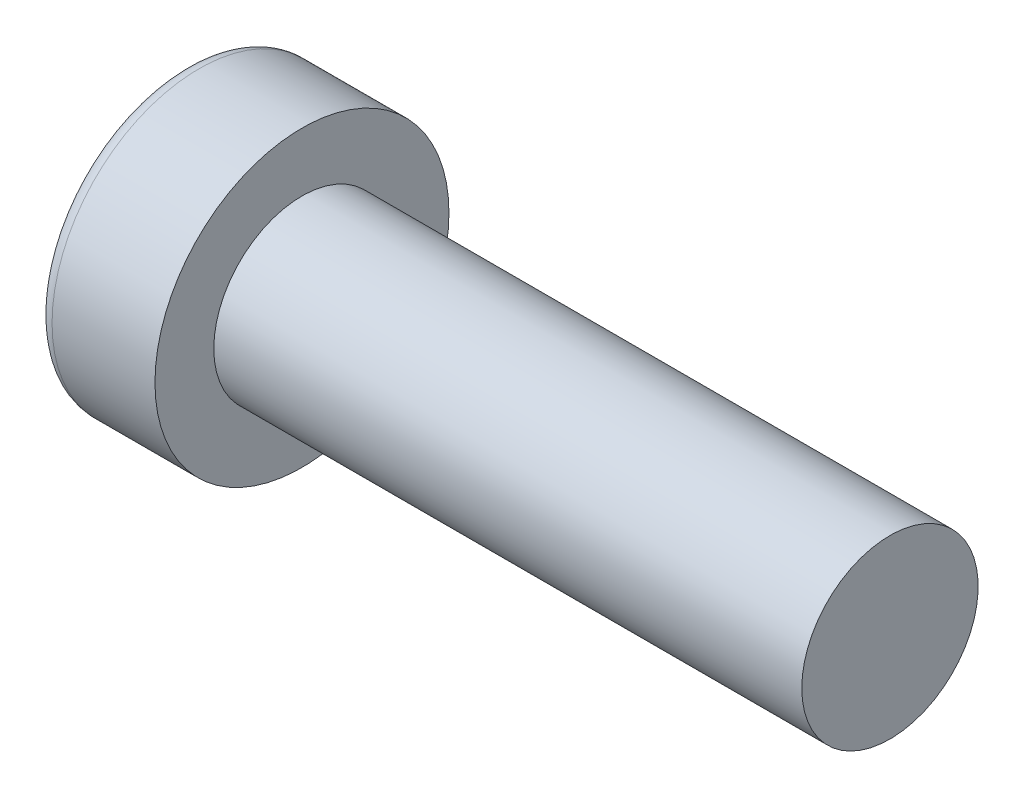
ISO-10303-21;
HEADER;
FILE_DESCRIPTION(('STEP AP214'),'2;1');
FILE_NAME('part.step','',(''),(''),'','','');
FILE_SCHEMA(('AUTOMOTIVE_DESIGN { 1 0 10303 214 1 1 1 1 }'));
ENDSEC;
DATA;
#1=APPLICATION_CONTEXT('core data for automotive mechanical design processes');
#2=APPLICATION_PROTOCOL_DEFINITION('international standard','automotive_design',2000,#1);
#3=PRODUCT_CONTEXT('',#1,'mechanical');
#4=PRODUCT('Part','Part','',(#3));
#5=PRODUCT_RELATED_PRODUCT_CATEGORY('part','',(#4));
#6=PRODUCT_DEFINITION_FORMATION('','',#4);
#7=PRODUCT_DEFINITION_CONTEXT('part definition',#1,'design');
#8=PRODUCT_DEFINITION('design','',#6,#7);
#9=PRODUCT_DEFINITION_SHAPE('','',#8);
#10=(LENGTH_UNIT() NAMED_UNIT(*) SI_UNIT(.MILLI.,.METRE.));
#11=(NAMED_UNIT(*) PLANE_ANGLE_UNIT() SI_UNIT($,.RADIAN.));
#12=(NAMED_UNIT(*) SI_UNIT($,.STERADIAN.) SOLID_ANGLE_UNIT());
#13=UNCERTAINTY_MEASURE_WITH_UNIT(LENGTH_MEASURE(1.E-05),#10,'distance_accuracy_value','');
#14=(GEOMETRIC_REPRESENTATION_CONTEXT(3) GLOBAL_UNCERTAINTY_ASSIGNED_CONTEXT((#13)) GLOBAL_UNIT_ASSIGNED_CONTEXT((#10,
#11,#12)) REPRESENTATION_CONTEXT('',''));
#15=CARTESIAN_POINT('',(0.,0.,0.));
#16=DIRECTION('',(0.,0.,1.));
#17=DIRECTION('',(1.,0.,0.));
#18=AXIS2_PLACEMENT_3D('',#15,#16,#17);
#19=CARTESIAN_POINT('',(-20.,5.,0.));
#20=DIRECTION('',(-1.,0.,0.));
#21=DIRECTION('',(0.,0.,1.));
#22=AXIS2_PLACEMENT_3D('',#19,#20,#21);
#23=PLANE('',#22);
#24=CARTESIAN_POINT('',(-20.,0.,0.));
#25=DIRECTION('',(-1.,0.,0.));
#26=DIRECTION('',(0.,0.,1.));
#27=AXIS2_PLACEMENT_3D('',#24,#25,#26);
#28=CIRCLE('',#27,5.);
#29=CARTESIAN_POINT('',(-20.,0.,5.));
#30=VERTEX_POINT('',#29);
#31=EDGE_CURVE('E147',#30,#30,#28,.T.);
#32=ORIENTED_EDGE('',*,*,#31,.F.);
#33=EDGE_LOOP('',(#32));
#34=FACE_BOUND('',#33,.T.);
#35=CARTESIAN_POINT('',(-20.,0.,0.));
#36=DIRECTION('',(-1.,0.,0.));
#37=DIRECTION('',(0.,0.,1.));
#38=AXIS2_PLACEMENT_3D('',#35,#36,#37);
#39=CIRCLE('',#38,3.);
#40=CARTESIAN_POINT('',(-20.,0.,3.));
#41=VERTEX_POINT('',#40);
#42=EDGE_CURVE('E136',#41,#41,#39,.T.);
#43=ORIENTED_EDGE('',*,*,#42,.T.);
#44=EDGE_LOOP('',(#43));
#45=FACE_BOUND('',#44,.T.);
#46=ADVANCED_FACE('F34',(#34,#45),#23,.F.);
#47=CARTESIAN_POINT('',(-65.0118083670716,0.,0.));
#48=DIRECTION('',(-1.,0.,0.));
#49=DIRECTION('',(0.,0.,1.));
#50=AXIS2_PLACEMENT_3D('',#47,#48,#49);
#51=CYLINDRICAL_SURFACE('',#50,5.);
#52=CARTESIAN_POINT('',(-23.5,0.,0.));
#53=DIRECTION('',(1.,0.,0.));
#54=DIRECTION('',(0.,0.,-1.));
#55=AXIS2_PLACEMENT_3D('',#52,#53,#54);
#56=CIRCLE('',#55,5.);
#57=CARTESIAN_POINT('',(-23.5,0.,-5.));
#58=VERTEX_POINT('',#57);
#59=EDGE_CURVE('E11',#58,#58,#56,.T.);
#60=ORIENTED_EDGE('',*,*,#59,.T.);
#61=EDGE_LOOP('',(#60));
#62=FACE_BOUND('',#61,.T.);
#63=ORIENTED_EDGE('',*,*,#31,.T.);
#64=EDGE_LOOP('',(#63));
#65=FACE_BOUND('',#64,.T.);
#66=ADVANCED_FACE('F169',(#62,#65),#51,.T.);
#67=CARTESIAN_POINT('',(-24.,0.,0.));
#68=DIRECTION('',(1.,0.,0.));
#69=DIRECTION('',(0.,0.,-1.));
#70=AXIS2_PLACEMENT_3D('',#67,#68,#69);
#71=PLANE('',#70);
#72=DIRECTION('',(0.,0.5,-0.866025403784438));
#73=VECTOR('',#72,1.);
#74=CARTESIAN_POINT('',(-24.,1.15470053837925,2.));
#75=LINE('',#74,#73);
#76=CARTESIAN_POINT('',(-24.,1.15470053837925,2.));
#77=VERTEX_POINT('',#76);
#78=CARTESIAN_POINT('',(-24.,2.3094010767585,0.));
#79=VERTEX_POINT('',#78);
#80=EDGE_CURVE('E123',#77,#79,#75,.T.);
#81=ORIENTED_EDGE('',*,*,#80,.F.);
#82=DIRECTION('',(0.,1.,0.));
#83=VECTOR('',#82,1.);
#84=CARTESIAN_POINT('',(-24.,-1.15470053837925,2.));
#85=LINE('',#84,#83);
#86=CARTESIAN_POINT('',(-24.,-1.15470053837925,2.));
#87=VERTEX_POINT('',#86);
#88=EDGE_CURVE('E49',#87,#77,#85,.T.);
#89=ORIENTED_EDGE('',*,*,#88,.F.);
#90=DIRECTION('',(0.,0.5,0.866025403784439));
#91=VECTOR('',#90,1.);
#92=CARTESIAN_POINT('',(-24.,-2.3094010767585,0.));
#93=LINE('',#92,#91);
#94=CARTESIAN_POINT('',(-24.,-2.3094010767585,0.));
#95=VERTEX_POINT('',#94);
#96=EDGE_CURVE('E132',#95,#87,#93,.T.);
#97=ORIENTED_EDGE('',*,*,#96,.F.);
#98=DIRECTION('',(0.,-0.5,0.866025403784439));
#99=VECTOR('',#98,1.);
#100=CARTESIAN_POINT('',(-24.,-1.15470053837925,-2.));
#101=LINE('',#100,#99);
#102=CARTESIAN_POINT('',(-24.,-1.15470053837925,-2.));
#103=VERTEX_POINT('',#102);
#104=EDGE_CURVE('E130',#103,#95,#101,.T.);
#105=ORIENTED_EDGE('',*,*,#104,.F.);
#106=DIRECTION('',(0.,-1.,0.));
#107=VECTOR('',#106,1.);
#108=CARTESIAN_POINT('',(-24.,1.15470053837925,-2.));
#109=LINE('',#108,#107);
#110=CARTESIAN_POINT('',(-24.,1.15470053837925,-2.));
#111=VERTEX_POINT('',#110);
#112=EDGE_CURVE('E97',#111,#103,#109,.T.);
#113=ORIENTED_EDGE('',*,*,#112,.F.);
#114=DIRECTION('',(0.,-0.5,-0.866025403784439));
#115=VECTOR('',#114,1.);
#116=CARTESIAN_POINT('',(-24.,2.3094010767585,0.));
#117=LINE('',#116,#115);
#118=EDGE_CURVE('E126',#79,#111,#117,.T.);
#119=ORIENTED_EDGE('',*,*,#118,.F.);
#120=EDGE_LOOP('',(#81,#89,#97,#105,#113,#119));
#121=FACE_BOUND('',#120,.T.);
#122=CARTESIAN_POINT('',(-24.,0.,0.));
#123=DIRECTION('',(1.,0.,0.));
#124=DIRECTION('',(0.,0.,-1.));
#125=AXIS2_PLACEMENT_3D('',#122,#123,#124);
#126=CIRCLE('',#125,4.5);
#127=CARTESIAN_POINT('',(-24.,0.,-4.5));
#128=VERTEX_POINT('',#127);
#129=EDGE_CURVE('E42',#128,#128,#126,.F.);
#130=ORIENTED_EDGE('',*,*,#129,.T.);
#131=EDGE_LOOP('',(#130));
#132=FACE_BOUND('',#131,.T.);
#133=ADVANCED_FACE('F152',(#121,#132),#71,.F.);
#134=CARTESIAN_POINT('',(0.,3.,0.));
#135=DIRECTION('',(-1.,0.,0.));
#136=DIRECTION('',(0.,0.,1.));
#137=AXIS2_PLACEMENT_3D('',#134,#135,#136);
#138=PLANE('',#137);
#139=CARTESIAN_POINT('',(0.,0.,0.));
#140=DIRECTION('',(-1.,0.,0.));
#141=DIRECTION('',(0.,0.,1.));
#142=AXIS2_PLACEMENT_3D('',#139,#140,#141);
#143=CIRCLE('',#142,3.);
#144=CARTESIAN_POINT('',(0.,0.,3.));
#145=VERTEX_POINT('',#144);
#146=EDGE_CURVE('E144',#145,#145,#143,.T.);
#147=ORIENTED_EDGE('',*,*,#146,.F.);
#148=EDGE_LOOP('',(#147));
#149=FACE_BOUND('',#148,.T.);
#150=ADVANCED_FACE('F164',(#149),#138,.F.);
#151=CARTESIAN_POINT('',(-65.0118083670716,0.,0.));
#152=DIRECTION('',(-1.,0.,0.));
#153=DIRECTION('',(0.,0.,1.));
#154=AXIS2_PLACEMENT_3D('',#151,#152,#153);
#155=CYLINDRICAL_SURFACE('',#154,3.);
#156=ORIENTED_EDGE('',*,*,#42,.F.);
#157=EDGE_LOOP('',(#156));
#158=FACE_BOUND('',#157,.T.);
#159=ORIENTED_EDGE('',*,*,#146,.T.);
#160=EDGE_LOOP('',(#159));
#161=FACE_BOUND('',#160,.T.);
#162=ADVANCED_FACE('F156',(#158,#161),#155,.T.);
#163=CARTESIAN_POINT('',(-23.5,0.,0.));
#164=DIRECTION('',(1.,0.,0.));
#165=DIRECTION('',(0.,0.,-1.));
#166=AXIS2_PLACEMENT_3D('',#163,#164,#165);
#167=TOROIDAL_SURFACE('',#166,4.5,0.5);
#168=ORIENTED_EDGE('',*,*,#59,.F.);
#169=EDGE_LOOP('',(#168));
#170=FACE_BOUND('',#169,.T.);
#171=ORIENTED_EDGE('',*,*,#129,.F.);
#172=EDGE_LOOP('',(#171));
#173=FACE_BOUND('',#172,.T.);
#174=ADVANCED_FACE('F36',(#170,#173),#167,.T.);
#175=CARTESIAN_POINT('',(-21.,-1.15470053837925,2.));
#176=DIRECTION('',(0.,0.,1.));
#177=DIRECTION('',(1.,0.,0.));
#178=AXIS2_PLACEMENT_3D('',#175,#176,#177);
#179=PLANE('',#178);
#180=ORIENTED_EDGE('',*,*,#88,.T.);
#181=DIRECTION('',(-1.,0.,0.));
#182=VECTOR('',#181,1.);
#183=CARTESIAN_POINT('',(-21.,1.15470053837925,2.));
#184=LINE('',#183,#182);
#185=CARTESIAN_POINT('',(-21.,1.15470053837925,2.));
#186=VERTEX_POINT('',#185);
#187=EDGE_CURVE('E79',#186,#77,#184,.T.);
#188=ORIENTED_EDGE('',*,*,#187,.F.);
#189=DIRECTION('',(0.,1.,0.));
#190=VECTOR('',#189,1.);
#191=CARTESIAN_POINT('',(-21.,-1.15470053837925,2.));
#192=LINE('',#191,#190);
#193=CARTESIAN_POINT('',(-21.,-1.15470053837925,2.));
#194=VERTEX_POINT('',#193);
#195=EDGE_CURVE('E134',#194,#186,#192,.T.);
#196=ORIENTED_EDGE('',*,*,#195,.F.);
#197=DIRECTION('',(-1.,0.,0.));
#198=VECTOR('',#197,1.);
#199=CARTESIAN_POINT('',(-21.,-1.15470053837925,2.));
#200=LINE('',#199,#198);
#201=EDGE_CURVE('E57',#194,#87,#200,.T.);
#202=ORIENTED_EDGE('',*,*,#201,.T.);
#203=EDGE_LOOP('',(#180,#188,#196,#202));
#204=FACE_BOUND('',#203,.T.);
#205=ADVANCED_FACE('F155',(#204),#179,.F.);
#206=CARTESIAN_POINT('',(-21.,-2.3094010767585,0.));
#207=DIRECTION('',(0.,-0.866025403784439,0.5));
#208=DIRECTION('',(0.,-0.5,-0.866025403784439));
#209=AXIS2_PLACEMENT_3D('',#206,#207,#208);
#210=PLANE('',#209);
#211=ORIENTED_EDGE('',*,*,#96,.T.);
#212=ORIENTED_EDGE('',*,*,#201,.F.);
#213=DIRECTION('',(0.,0.5,0.866025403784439));
#214=VECTOR('',#213,1.);
#215=CARTESIAN_POINT('',(-21.,-2.3094010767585,0.));
#216=LINE('',#215,#214);
#217=CARTESIAN_POINT('',(-21.,-2.3094010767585,0.));
#218=VERTEX_POINT('',#217);
#219=EDGE_CURVE('E109',#218,#194,#216,.T.);
#220=ORIENTED_EDGE('',*,*,#219,.F.);
#221=DIRECTION('',(-1.,0.,0.));
#222=VECTOR('',#221,1.);
#223=CARTESIAN_POINT('',(-21.,-2.3094010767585,0.));
#224=LINE('',#223,#222);
#225=EDGE_CURVE('E101',#218,#95,#224,.T.);
#226=ORIENTED_EDGE('',*,*,#225,.T.);
#227=EDGE_LOOP('',(#211,#212,#220,#226));
#228=FACE_BOUND('',#227,.T.);
#229=ADVANCED_FACE('F162',(#228),#210,.F.);
#230=CARTESIAN_POINT('',(-21.,-1.15470053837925,-2.));
#231=DIRECTION('',(0.,-0.866025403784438,-0.5));
#232=DIRECTION('',(0.,0.5,-0.866025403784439));
#233=AXIS2_PLACEMENT_3D('',#230,#231,#232);
#234=PLANE('',#233);
#235=ORIENTED_EDGE('',*,*,#104,.T.);
#236=ORIENTED_EDGE('',*,*,#225,.F.);
#237=DIRECTION('',(0.,-0.5,0.866025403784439));
#238=VECTOR('',#237,1.);
#239=CARTESIAN_POINT('',(-21.,-1.15470053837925,-2.));
#240=LINE('',#239,#238);
#241=CARTESIAN_POINT('',(-21.,-1.15470053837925,-2.));
#242=VERTEX_POINT('',#241);
#243=EDGE_CURVE('E105',#242,#218,#240,.T.);
#244=ORIENTED_EDGE('',*,*,#243,.F.);
#245=DIRECTION('',(-1.,0.,0.));
#246=VECTOR('',#245,1.);
#247=CARTESIAN_POINT('',(-21.,-1.15470053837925,-2.));
#248=LINE('',#247,#246);
#249=EDGE_CURVE('E90',#242,#103,#248,.T.);
#250=ORIENTED_EDGE('',*,*,#249,.T.);
#251=EDGE_LOOP('',(#235,#236,#244,#250));
#252=FACE_BOUND('',#251,.T.);
#253=ADVANCED_FACE('F106',(#252),#234,.F.);
#254=CARTESIAN_POINT('',(-21.,1.15470053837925,-2.));
#255=DIRECTION('',(0.,0.,-1.));
#256=DIRECTION('',(-1.,0.,0.));
#257=AXIS2_PLACEMENT_3D('',#254,#255,#256);
#258=PLANE('',#257);
#259=ORIENTED_EDGE('',*,*,#112,.T.);
#260=ORIENTED_EDGE('',*,*,#249,.F.);
#261=DIRECTION('',(0.,-1.,0.));
#262=VECTOR('',#261,1.);
#263=CARTESIAN_POINT('',(-21.,1.15470053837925,-2.));
#264=LINE('',#263,#262);
#265=CARTESIAN_POINT('',(-21.,1.15470053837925,-2.));
#266=VERTEX_POINT('',#265);
#267=EDGE_CURVE('E94',#266,#242,#264,.T.);
#268=ORIENTED_EDGE('',*,*,#267,.F.);
#269=DIRECTION('',(-1.,0.,0.));
#270=VECTOR('',#269,1.);
#271=CARTESIAN_POINT('',(-21.,1.15470053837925,-2.));
#272=LINE('',#271,#270);
#273=EDGE_CURVE('E102',#266,#111,#272,.T.);
#274=ORIENTED_EDGE('',*,*,#273,.T.);
#275=EDGE_LOOP('',(#259,#260,#268,#274));
#276=FACE_BOUND('',#275,.T.);
#277=ADVANCED_FACE('F92',(#276),#258,.F.);
#278=CARTESIAN_POINT('',(-21.,2.3094010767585,0.));
#279=DIRECTION('',(0.,0.866025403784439,-0.5));
#280=DIRECTION('',(0.,0.5,0.866025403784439));
#281=AXIS2_PLACEMENT_3D('',#278,#279,#280);
#282=PLANE('',#281);
#283=ORIENTED_EDGE('',*,*,#118,.T.);
#284=ORIENTED_EDGE('',*,*,#273,.F.);
#285=DIRECTION('',(0.,-0.5,-0.866025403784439));
#286=VECTOR('',#285,1.);
#287=CARTESIAN_POINT('',(-21.,2.3094010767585,0.));
#288=LINE('',#287,#286);
#289=CARTESIAN_POINT('',(-21.,2.3094010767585,0.));
#290=VERTEX_POINT('',#289);
#291=EDGE_CURVE('E115',#290,#266,#288,.T.);
#292=ORIENTED_EDGE('',*,*,#291,.F.);
#293=DIRECTION('',(-1.,0.,0.));
#294=VECTOR('',#293,1.);
#295=CARTESIAN_POINT('',(-21.,2.3094010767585,0.));
#296=LINE('',#295,#294);
#297=EDGE_CURVE('E139',#290,#79,#296,.T.);
#298=ORIENTED_EDGE('',*,*,#297,.T.);
#299=EDGE_LOOP('',(#283,#284,#292,#298));
#300=FACE_BOUND('',#299,.T.);
#301=ADVANCED_FACE('F188',(#300),#282,.F.);
#302=CARTESIAN_POINT('',(-21.,1.15470053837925,2.));
#303=DIRECTION('',(0.,0.866025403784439,0.5));
#304=DIRECTION('',(0.,-0.5,0.866025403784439));
#305=AXIS2_PLACEMENT_3D('',#302,#303,#304);
#306=PLANE('',#305);
#307=ORIENTED_EDGE('',*,*,#80,.T.);
#308=ORIENTED_EDGE('',*,*,#297,.F.);
#309=DIRECTION('',(0.,0.5,-0.866025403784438));
#310=VECTOR('',#309,1.);
#311=CARTESIAN_POINT('',(-21.,1.15470053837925,2.));
#312=LINE('',#311,#310);
#313=EDGE_CURVE('E117',#186,#290,#312,.T.);
#314=ORIENTED_EDGE('',*,*,#313,.F.);
#315=ORIENTED_EDGE('',*,*,#187,.T.);
#316=EDGE_LOOP('',(#307,#308,#314,#315));
#317=FACE_BOUND('',#316,.T.);
#318=ADVANCED_FACE('F185',(#317),#306,.F.);
#319=CARTESIAN_POINT('',(-21.,0.,0.));
#320=DIRECTION('',(-1.,0.,0.));
#321=DIRECTION('',(0.,0.,1.));
#322=AXIS2_PLACEMENT_3D('',#319,#320,#321);
#323=PLANE('',#322);
#324=ORIENTED_EDGE('',*,*,#195,.T.);
#325=ORIENTED_EDGE('',*,*,#313,.T.);
#326=ORIENTED_EDGE('',*,*,#291,.T.);
#327=ORIENTED_EDGE('',*,*,#267,.T.);
#328=ORIENTED_EDGE('',*,*,#243,.T.);
#329=ORIENTED_EDGE('',*,*,#219,.T.);
#330=EDGE_LOOP('',(#324,#325,#326,#327,#328,#329));
#331=FACE_BOUND('',#330,.T.);
#332=ADVANCED_FACE('F112',(#331),#323,.T.);
#333=CLOSED_SHELL('',(#46,#66,#133,#150,#162,#174,#205,#229,#253,#277,#301,#318,#332));
#334=MANIFOLD_SOLID_BREP('B2',#333);
#335=ADVANCED_BREP_SHAPE_REPRESENTATION('',(#18,#334),#14);
#336=SHAPE_DEFINITION_REPRESENTATION(#9,#335);
ENDSEC;
END-ISO-10303-21;
